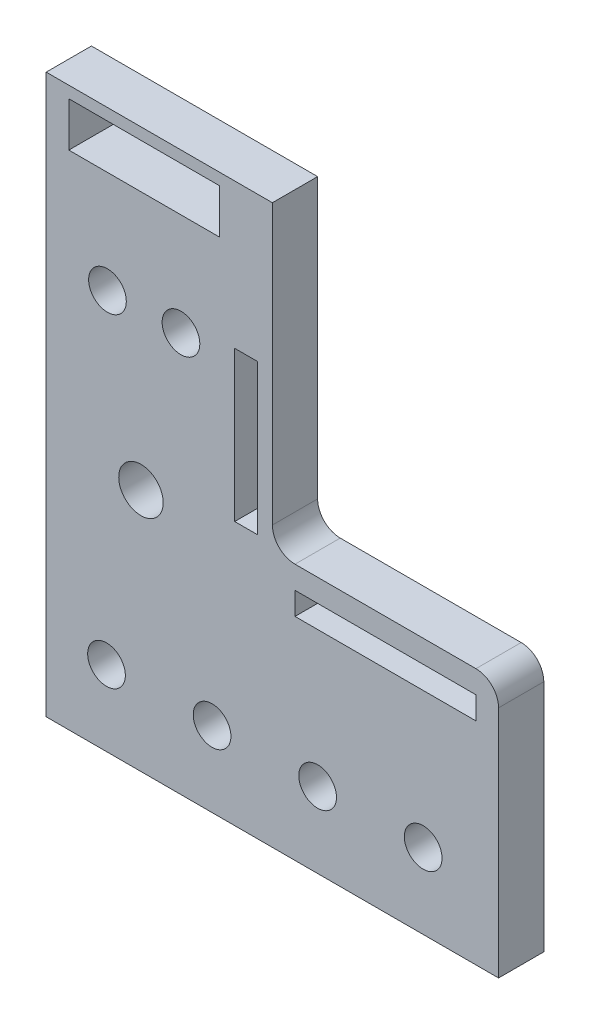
ISO-10303-21;
HEADER;
FILE_DESCRIPTION(('STEP AP214'),'2;1');
FILE_NAME('part.step','',(''),(''),'','','');
FILE_SCHEMA(('AUTOMOTIVE_DESIGN { 1 0 10303 214 1 1 1 1 }'));
ENDSEC;
DATA;
#1=APPLICATION_CONTEXT('core data for automotive mechanical design processes');
#2=APPLICATION_PROTOCOL_DEFINITION('international standard','automotive_design',2000,#1);
#3=PRODUCT_CONTEXT('',#1,'mechanical');
#4=PRODUCT('Part','Part','',(#3));
#5=PRODUCT_RELATED_PRODUCT_CATEGORY('part','',(#4));
#6=PRODUCT_DEFINITION_FORMATION('','',#4);
#7=PRODUCT_DEFINITION_CONTEXT('part definition',#1,'design');
#8=PRODUCT_DEFINITION('design','',#6,#7);
#9=PRODUCT_DEFINITION_SHAPE('','',#8);
#10=(LENGTH_UNIT() NAMED_UNIT(*) SI_UNIT(.MILLI.,.METRE.));
#11=(NAMED_UNIT(*) PLANE_ANGLE_UNIT() SI_UNIT($,.RADIAN.));
#12=(NAMED_UNIT(*) SI_UNIT($,.STERADIAN.) SOLID_ANGLE_UNIT());
#13=UNCERTAINTY_MEASURE_WITH_UNIT(LENGTH_MEASURE(1.E-05),#10,'distance_accuracy_value','');
#14=(GEOMETRIC_REPRESENTATION_CONTEXT(3) GLOBAL_UNCERTAINTY_ASSIGNED_CONTEXT((#13)) GLOBAL_UNIT_ASSIGNED_CONTEXT((#10,
#11,#12)) REPRESENTATION_CONTEXT('',''));
#15=CARTESIAN_POINT('',(0.,0.,0.));
#16=DIRECTION('',(0.,0.,1.));
#17=DIRECTION('',(1.,0.,0.));
#18=AXIS2_PLACEMENT_3D('',#15,#16,#17);
#19=CARTESIAN_POINT('',(-271.028662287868,23.730506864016,6.));
#20=DIRECTION('',(0.,0.,1.));
#21=DIRECTION('',(1.,0.,0.));
#22=AXIS2_PLACEMENT_3D('',#19,#20,#21);
#23=PLANE('',#22);
#24=CARTESIAN_POINT('',(-315.457743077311,25.0381031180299,6.));
#25=DIRECTION('',(0.,0.,1.));
#26=DIRECTION('',(1.,0.,0.));
#27=AXIS2_PLACEMENT_3D('',#24,#25,#26);
#28=CIRCLE('',#27,2.95000000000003);
#29=CARTESIAN_POINT('',(-312.507743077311,25.0381031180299,6.));
#30=VERTEX_POINT('',#29);
#31=EDGE_CURVE('E724',#30,#30,#28,.T.);
#32=ORIENTED_EDGE('',*,*,#31,.F.);
#33=EDGE_LOOP('',(#32));
#34=FACE_BOUND('',#33,.T.);
#35=DIRECTION('',(0.,-1.,0.));
#36=VECTOR('',#35,1.);
#37=CARTESIAN_POINT('',(-325.028662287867,65.1958099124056,6.));
#38=LINE('',#37,#36);
#39=CARTESIAN_POINT('',(-325.028662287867,65.1958099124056,6.));
#40=VERTEX_POINT('',#39);
#41=CARTESIAN_POINT('',(-325.028662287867,59.2958099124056,6.));
#42=VERTEX_POINT('',#41);
#43=EDGE_CURVE('E210',#40,#42,#38,.T.);
#44=ORIENTED_EDGE('',*,*,#43,.F.);
#45=DIRECTION('',(-1.,0.,0.));
#46=VECTOR('',#45,1.);
#47=CARTESIAN_POINT('',(-305.028662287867,65.1958099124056,6.));
#48=LINE('',#47,#46);
#49=CARTESIAN_POINT('',(-305.028662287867,65.1958099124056,6.));
#50=VERTEX_POINT('',#49);
#51=EDGE_CURVE('E208',#50,#40,#48,.T.);
#52=ORIENTED_EDGE('',*,*,#51,.F.);
#53=DIRECTION('',(0.,1.,0.));
#54=VECTOR('',#53,1.);
#55=CARTESIAN_POINT('',(-305.028662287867,59.2958099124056,6.));
#56=LINE('',#55,#54);
#57=CARTESIAN_POINT('',(-305.028662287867,59.2958099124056,6.));
#58=VERTEX_POINT('',#57);
#59=EDGE_CURVE('E216',#58,#50,#56,.T.);
#60=ORIENTED_EDGE('',*,*,#59,.F.);
#61=DIRECTION('',(1.,0.,0.));
#62=VECTOR('',#61,1.);
#63=CARTESIAN_POINT('',(-325.028662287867,59.2958099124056,6.));
#64=LINE('',#63,#62);
#65=EDGE_CURVE('E213',#42,#58,#64,.T.);
#66=ORIENTED_EDGE('',*,*,#65,.F.);
#67=EDGE_LOOP('',(#44,#52,#60,#66));
#68=FACE_BOUND('',#67,.T.);
#69=CARTESIAN_POINT('',(-319.903662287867,45.7269541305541,6.));
#70=DIRECTION('',(0.,0.,1.));
#71=DIRECTION('',(1.,0.,0.));
#72=AXIS2_PLACEMENT_3D('',#69,#70,#71);
#73=CIRCLE('',#72,2.50000000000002);
#74=CARTESIAN_POINT('',(-317.403662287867,45.7269541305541,6.));
#75=VERTEX_POINT('',#74);
#76=EDGE_CURVE('E245',#75,#75,#73,.T.);
#77=ORIENTED_EDGE('',*,*,#76,.F.);
#78=EDGE_LOOP('',(#77));
#79=FACE_BOUND('',#78,.T.);
#80=CARTESIAN_POINT('',(-292.028662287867,2.69858037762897,6.));
#81=DIRECTION('',(0.,0.,1.));
#82=DIRECTION('',(1.,0.,0.));
#83=AXIS2_PLACEMENT_3D('',#80,#81,#82);
#84=CIRCLE('',#83,2.50000000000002);
#85=CARTESIAN_POINT('',(-289.528662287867,2.69858037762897,6.));
#86=VERTEX_POINT('',#85);
#87=EDGE_CURVE('E257',#86,#86,#84,.T.);
#88=ORIENTED_EDGE('',*,*,#87,.F.);
#89=EDGE_LOOP('',(#88));
#90=FACE_BOUND('',#89,.T.);
#91=CARTESIAN_POINT('',(-320.028662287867,2.69858037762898,6.));
#92=DIRECTION('',(0.,0.,1.));
#93=DIRECTION('',(1.,0.,0.));
#94=AXIS2_PLACEMENT_3D('',#91,#92,#93);
#95=CIRCLE('',#94,2.50000000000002);
#96=CARTESIAN_POINT('',(-317.528662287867,2.69858037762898,6.));
#97=VERTEX_POINT('',#96);
#98=EDGE_CURVE('E269',#97,#97,#95,.T.);
#99=ORIENTED_EDGE('',*,*,#98,.F.);
#100=EDGE_LOOP('',(#99));
#101=FACE_BOUND('',#100,.T.);
#102=DIRECTION('',(-1.,0.,0.));
#103=VECTOR('',#102,1.);
#104=CARTESIAN_POINT('',(-298.028662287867,66.7514584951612,6.));
#105=LINE('',#104,#103);
#106=CARTESIAN_POINT('',(-298.028662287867,66.7514584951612,6.));
#107=VERTEX_POINT('',#106);
#108=CARTESIAN_POINT('',(-328.028662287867,66.7514584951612,6.));
#109=VERTEX_POINT('',#108);
#110=EDGE_CURVE('E306',#107,#109,#105,.T.);
#111=ORIENTED_EDGE('',*,*,#110,.T.);
#112=DIRECTION('',(0.,-1.,0.));
#113=VECTOR('',#112,1.);
#114=CARTESIAN_POINT('',(-328.028662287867,66.7514584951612,6.));
#115=LINE('',#114,#113);
#116=CARTESIAN_POINT('',(-328.028662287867,-7.30141962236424,6.));
#117=VERTEX_POINT('',#116);
#118=EDGE_CURVE('E309',#109,#117,#115,.T.);
#119=ORIENTED_EDGE('',*,*,#118,.T.);
#120=DIRECTION('',(1.,0.,0.));
#121=VECTOR('',#120,1.);
#122=CARTESIAN_POINT('',(-328.028662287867,-7.30141962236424,6.));
#123=LINE('',#122,#121);
#124=CARTESIAN_POINT('',(-268.028662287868,-7.30141962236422,6.));
#125=VERTEX_POINT('',#124);
#126=EDGE_CURVE('E312',#117,#125,#123,.T.);
#127=ORIENTED_EDGE('',*,*,#126,.T.);
#128=DIRECTION('',(0.,1.,0.));
#129=VECTOR('',#128,1.);
#130=CARTESIAN_POINT('',(-268.028662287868,-7.30141962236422,6.));
#131=LINE('',#130,#129);
#132=CARTESIAN_POINT('',(-268.028662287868,23.730506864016,6.));
#133=VERTEX_POINT('',#132);
#134=EDGE_CURVE('E314',#125,#133,#131,.T.);
#135=ORIENTED_EDGE('',*,*,#134,.T.);
#136=CARTESIAN_POINT('',(-271.028662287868,23.730506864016,6.));
#137=DIRECTION('',(0.,0.,1.));
#138=DIRECTION('',(1.,0.,0.));
#139=AXIS2_PLACEMENT_3D('',#136,#137,#138);
#140=CIRCLE('',#139,3.);
#141=CARTESIAN_POINT('',(-271.028662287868,26.730506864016,6.));
#142=VERTEX_POINT('',#141);
#143=EDGE_CURVE('E316',#133,#142,#140,.T.);
#144=ORIENTED_EDGE('',*,*,#143,.T.);
#145=DIRECTION('',(-1.,0.,0.));
#146=VECTOR('',#145,1.);
#147=CARTESIAN_POINT('',(-271.028662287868,26.730506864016,6.));
#148=LINE('',#147,#146);
#149=CARTESIAN_POINT('',(-295.028662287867,26.730506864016,6.));
#150=VERTEX_POINT('',#149);
#151=EDGE_CURVE('E318',#142,#150,#148,.T.);
#152=ORIENTED_EDGE('',*,*,#151,.T.);
#153=CARTESIAN_POINT('',(-295.028662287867,29.7305068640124,6.));
#154=DIRECTION('',(0.,0.,-1.));
#155=DIRECTION('',(-1.,0.,0.));
#156=AXIS2_PLACEMENT_3D('',#153,#154,#155);
#157=CIRCLE('',#156,2.99999999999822);
#158=CARTESIAN_POINT('',(-298.028662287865,29.7305068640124,6.));
#159=VERTEX_POINT('',#158);
#160=EDGE_CURVE('E320',#150,#159,#157,.T.);
#161=ORIENTED_EDGE('',*,*,#160,.T.);
#162=DIRECTION('',(0.,1.,0.));
#163=VECTOR('',#162,1.);
#164=CARTESIAN_POINT('',(-298.028662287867,29.7305068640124,6.));
#165=LINE('',#164,#163);
#166=EDGE_CURVE('E322',#159,#107,#165,.T.);
#167=ORIENTED_EDGE('',*,*,#166,.T.);
#168=EDGE_LOOP('',(#111,#119,#127,#135,#144,#152,#161,#167));
#169=FACE_BOUND('',#168,.T.);
#170=DIRECTION('',(-1.,0.,0.));
#171=VECTOR('',#170,1.);
#172=CARTESIAN_POINT('',(-271.028662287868,23.730506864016,6.));
#173=LINE('',#172,#171);
#174=CARTESIAN_POINT('',(-271.028662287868,23.730506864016,6.));
#175=VERTEX_POINT('',#174);
#176=CARTESIAN_POINT('',(-295.028662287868,23.730506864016,6.));
#177=VERTEX_POINT('',#176);
#178=EDGE_CURVE('E277',#175,#177,#173,.T.);
#179=ORIENTED_EDGE('',*,*,#178,.F.);
#180=DIRECTION('',(0.,1.,0.));
#181=VECTOR('',#180,1.);
#182=CARTESIAN_POINT('',(-271.028662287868,23.730506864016,6.));
#183=LINE('',#182,#181);
#184=CARTESIAN_POINT('',(-271.028662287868,20.730506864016,6.));
#185=VERTEX_POINT('',#184);
#186=EDGE_CURVE('E275',#185,#175,#183,.T.);
#187=ORIENTED_EDGE('',*,*,#186,.F.);
#188=DIRECTION('',(1.,0.,0.));
#189=VECTOR('',#188,1.);
#190=CARTESIAN_POINT('',(-271.028662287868,20.730506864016,6.));
#191=LINE('',#190,#189);
#192=CARTESIAN_POINT('',(-295.028662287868,20.730506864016,6.));
#193=VERTEX_POINT('',#192);
#194=EDGE_CURVE('E283',#193,#185,#191,.T.);
#195=ORIENTED_EDGE('',*,*,#194,.F.);
#196=DIRECTION('',(0.,-1.,0.));
#197=VECTOR('',#196,1.);
#198=CARTESIAN_POINT('',(-295.028662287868,23.730506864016,6.));
#199=LINE('',#198,#197);
#200=EDGE_CURVE('E280',#177,#193,#199,.T.);
#201=ORIENTED_EDGE('',*,*,#200,.F.);
#202=EDGE_LOOP('',(#179,#187,#195,#201));
#203=FACE_BOUND('',#202,.T.);
#204=CARTESIAN_POINT('',(-306.028662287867,2.69858037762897,6.));
#205=DIRECTION('',(0.,0.,1.));
#206=DIRECTION('',(1.,0.,0.));
#207=AXIS2_PLACEMENT_3D('',#204,#205,#206);
#208=CIRCLE('',#207,2.50000000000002);
#209=CARTESIAN_POINT('',(-303.528662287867,2.69858037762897,6.));
#210=VERTEX_POINT('',#209);
#211=EDGE_CURVE('E263',#210,#210,#208,.T.);
#212=ORIENTED_EDGE('',*,*,#211,.F.);
#213=EDGE_LOOP('',(#212));
#214=FACE_BOUND('',#213,.T.);
#215=CARTESIAN_POINT('',(-278.028662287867,2.69858037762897,6.));
#216=DIRECTION('',(0.,0.,1.));
#217=DIRECTION('',(1.,0.,0.));
#218=AXIS2_PLACEMENT_3D('',#215,#216,#217);
#219=CIRCLE('',#218,2.50000000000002);
#220=CARTESIAN_POINT('',(-275.528662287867,2.69858037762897,6.));
#221=VERTEX_POINT('',#220);
#222=EDGE_CURVE('E251',#221,#221,#219,.T.);
#223=ORIENTED_EDGE('',*,*,#222,.F.);
#224=EDGE_LOOP('',(#223));
#225=FACE_BOUND('',#224,.T.);
#226=CARTESIAN_POINT('',(-310.153662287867,45.7269541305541,6.));
#227=DIRECTION('',(0.,0.,1.));
#228=DIRECTION('',(1.,0.,0.));
#229=AXIS2_PLACEMENT_3D('',#226,#227,#228);
#230=CIRCLE('',#229,2.50000000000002);
#231=CARTESIAN_POINT('',(-307.653662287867,45.7269541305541,6.));
#232=VERTEX_POINT('',#231);
#233=EDGE_CURVE('E239',#232,#232,#230,.T.);
#234=ORIENTED_EDGE('',*,*,#233,.F.);
#235=EDGE_LOOP('',(#234));
#236=FACE_BOUND('',#235,.T.);
#237=DIRECTION('',(1.,0.,0.));
#238=VECTOR('',#237,1.);
#239=CARTESIAN_POINT('',(-300.028662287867,27.6308045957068,6.));
#240=LINE('',#239,#238);
#241=CARTESIAN_POINT('',(-303.028662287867,27.6308045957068,6.));
#242=VERTEX_POINT('',#241);
#243=CARTESIAN_POINT('',(-300.028662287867,27.6308045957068,6.));
#244=VERTEX_POINT('',#243);
#245=EDGE_CURVE('E178',#242,#244,#240,.T.);
#246=ORIENTED_EDGE('',*,*,#245,.F.);
#247=DIRECTION('',(0.,-1.,0.));
#248=VECTOR('',#247,1.);
#249=CARTESIAN_POINT('',(-303.028662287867,27.6308045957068,6.));
#250=LINE('',#249,#248);
#251=CARTESIAN_POINT('',(-303.028662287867,47.5294663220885,6.));
#252=VERTEX_POINT('',#251);
#253=EDGE_CURVE('E170',#252,#242,#250,.T.);
#254=ORIENTED_EDGE('',*,*,#253,.F.);
#255=DIRECTION('',(-1.,0.,0.));
#256=VECTOR('',#255,1.);
#257=CARTESIAN_POINT('',(-303.028662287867,47.5294663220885,6.));
#258=LINE('',#257,#256);
#259=CARTESIAN_POINT('',(-300.028662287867,47.5294663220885,6.));
#260=VERTEX_POINT('',#259);
#261=EDGE_CURVE('E192',#260,#252,#258,.T.);
#262=ORIENTED_EDGE('',*,*,#261,.F.);
#263=DIRECTION('',(0.,1.,0.));
#264=VECTOR('',#263,1.);
#265=CARTESIAN_POINT('',(-300.028662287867,47.5294663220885,6.));
#266=LINE('',#265,#264);
#267=EDGE_CURVE('E190',#244,#260,#266,.T.);
#268=ORIENTED_EDGE('',*,*,#267,.F.);
#269=EDGE_LOOP('',(#246,#254,#262,#268));
#270=FACE_BOUND('',#269,.T.);
#271=ADVANCED_FACE('F33',(#34,#68,#79,#90,#101,#169,#203,#214,#225,#236,#270),#23,.T.);
#272=CARTESIAN_POINT('',(-271.028662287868,23.730506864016,0.));
#273=DIRECTION('',(0.,0.,1.));
#274=DIRECTION('',(1.,0.,0.));
#275=AXIS2_PLACEMENT_3D('',#272,#273,#274);
#276=PLANE('',#275);
#277=CARTESIAN_POINT('',(-315.457743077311,25.0381031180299,0.));
#278=DIRECTION('',(0.,0.,-1.));
#279=DIRECTION('',(-1.,0.,0.));
#280=AXIS2_PLACEMENT_3D('',#277,#278,#279);
#281=CIRCLE('',#280,2.95000000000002);
#282=CARTESIAN_POINT('',(-318.407743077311,25.0381031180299,0.));
#283=VERTEX_POINT('',#282);
#284=EDGE_CURVE('E198',#283,#283,#281,.T.);
#285=ORIENTED_EDGE('',*,*,#284,.F.);
#286=EDGE_LOOP('',(#285));
#287=FACE_BOUND('',#286,.T.);
#288=DIRECTION('',(-1.,0.,0.));
#289=VECTOR('',#288,1.);
#290=CARTESIAN_POINT('',(-305.028662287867,65.1958099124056,0.));
#291=LINE('',#290,#289);
#292=CARTESIAN_POINT('',(-305.028662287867,65.1958099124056,0.));
#293=VERTEX_POINT('',#292);
#294=CARTESIAN_POINT('',(-325.028662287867,65.1958099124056,0.));
#295=VERTEX_POINT('',#294);
#296=EDGE_CURVE('E186',#293,#295,#291,.T.);
#297=ORIENTED_EDGE('',*,*,#296,.T.);
#298=DIRECTION('',(0.,-1.,0.));
#299=VECTOR('',#298,1.);
#300=CARTESIAN_POINT('',(-325.028662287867,65.1958099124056,0.));
#301=LINE('',#300,#299);
#302=CARTESIAN_POINT('',(-325.028662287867,59.2958099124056,0.));
#303=VERTEX_POINT('',#302);
#304=EDGE_CURVE('E221',#295,#303,#301,.T.);
#305=ORIENTED_EDGE('',*,*,#304,.T.);
#306=DIRECTION('',(1.,0.,0.));
#307=VECTOR('',#306,1.);
#308=CARTESIAN_POINT('',(-325.028662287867,59.2958099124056,0.));
#309=LINE('',#308,#307);
#310=CARTESIAN_POINT('',(-305.028662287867,59.2958099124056,0.));
#311=VERTEX_POINT('',#310);
#312=EDGE_CURVE('E224',#303,#311,#309,.T.);
#313=ORIENTED_EDGE('',*,*,#312,.T.);
#314=DIRECTION('',(0.,1.,0.));
#315=VECTOR('',#314,1.);
#316=CARTESIAN_POINT('',(-305.028662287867,59.2958099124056,0.));
#317=LINE('',#316,#315);
#318=EDGE_CURVE('E211',#311,#293,#317,.T.);
#319=ORIENTED_EDGE('',*,*,#318,.T.);
#320=EDGE_LOOP('',(#297,#305,#313,#319));
#321=FACE_BOUND('',#320,.T.);
#322=CARTESIAN_POINT('',(-319.903662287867,45.7269541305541,0.));
#323=DIRECTION('',(0.,0.,1.));
#324=DIRECTION('',(1.,0.,0.));
#325=AXIS2_PLACEMENT_3D('',#322,#323,#324);
#326=CIRCLE('',#325,2.50000000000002);
#327=CARTESIAN_POINT('',(-317.403662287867,45.7269541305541,0.));
#328=VERTEX_POINT('',#327);
#329=EDGE_CURVE('E242',#328,#328,#326,.T.);
#330=ORIENTED_EDGE('',*,*,#329,.T.);
#331=EDGE_LOOP('',(#330));
#332=FACE_BOUND('',#331,.T.);
#333=CARTESIAN_POINT('',(-292.028662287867,2.69858037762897,0.));
#334=DIRECTION('',(0.,0.,1.));
#335=DIRECTION('',(1.,0.,0.));
#336=AXIS2_PLACEMENT_3D('',#333,#334,#335);
#337=CIRCLE('',#336,2.50000000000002);
#338=CARTESIAN_POINT('',(-289.528662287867,2.69858037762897,0.));
#339=VERTEX_POINT('',#338);
#340=EDGE_CURVE('E254',#339,#339,#337,.T.);
#341=ORIENTED_EDGE('',*,*,#340,.T.);
#342=EDGE_LOOP('',(#341));
#343=FACE_BOUND('',#342,.T.);
#344=CARTESIAN_POINT('',(-320.028662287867,2.69858037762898,0.));
#345=DIRECTION('',(0.,0.,1.));
#346=DIRECTION('',(1.,0.,0.));
#347=AXIS2_PLACEMENT_3D('',#344,#345,#346);
#348=CIRCLE('',#347,2.50000000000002);
#349=CARTESIAN_POINT('',(-317.528662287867,2.69858037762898,0.));
#350=VERTEX_POINT('',#349);
#351=EDGE_CURVE('E266',#350,#350,#348,.T.);
#352=ORIENTED_EDGE('',*,*,#351,.T.);
#353=EDGE_LOOP('',(#352));
#354=FACE_BOUND('',#353,.T.);
#355=DIRECTION('',(-1.,0.,0.));
#356=VECTOR('',#355,1.);
#357=CARTESIAN_POINT('',(-298.028662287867,66.7514584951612,0.));
#358=LINE('',#357,#356);
#359=CARTESIAN_POINT('',(-298.028662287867,66.7514584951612,0.));
#360=VERTEX_POINT('',#359);
#361=CARTESIAN_POINT('',(-328.028662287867,66.7514584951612,0.));
#362=VERTEX_POINT('',#361);
#363=EDGE_CURVE('E305',#360,#362,#358,.T.);
#364=ORIENTED_EDGE('',*,*,#363,.F.);
#365=DIRECTION('',(0.,1.,0.));
#366=VECTOR('',#365,1.);
#367=CARTESIAN_POINT('',(-298.028662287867,29.7305068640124,0.));
#368=LINE('',#367,#366);
#369=CARTESIAN_POINT('',(-298.028662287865,29.7305068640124,0.));
#370=VERTEX_POINT('',#369);
#371=EDGE_CURVE('E310',#370,#360,#368,.T.);
#372=ORIENTED_EDGE('',*,*,#371,.F.);
#373=CARTESIAN_POINT('',(-295.028662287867,29.7305068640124,0.));
#374=DIRECTION('',(0.,0.,-1.));
#375=DIRECTION('',(-1.,0.,0.));
#376=AXIS2_PLACEMENT_3D('',#373,#374,#375);
#377=CIRCLE('',#376,2.99999999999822);
#378=CARTESIAN_POINT('',(-295.028662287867,26.730506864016,0.));
#379=VERTEX_POINT('',#378);
#380=EDGE_CURVE('E337',#379,#370,#377,.T.);
#381=ORIENTED_EDGE('',*,*,#380,.F.);
#382=DIRECTION('',(-1.,0.,0.));
#383=VECTOR('',#382,1.);
#384=CARTESIAN_POINT('',(-271.028662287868,26.730506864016,0.));
#385=LINE('',#384,#383);
#386=CARTESIAN_POINT('',(-271.028662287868,26.730506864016,0.));
#387=VERTEX_POINT('',#386);
#388=EDGE_CURVE('E335',#387,#379,#385,.T.);
#389=ORIENTED_EDGE('',*,*,#388,.F.);
#390=CARTESIAN_POINT('',(-271.028662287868,23.730506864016,0.));
#391=DIRECTION('',(0.,0.,1.));
#392=DIRECTION('',(1.,0.,0.));
#393=AXIS2_PLACEMENT_3D('',#390,#391,#392);
#394=CIRCLE('',#393,3.);
#395=CARTESIAN_POINT('',(-268.028662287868,23.730506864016,0.));
#396=VERTEX_POINT('',#395);
#397=EDGE_CURVE('E333',#396,#387,#394,.T.);
#398=ORIENTED_EDGE('',*,*,#397,.F.);
#399=DIRECTION('',(0.,1.,0.));
#400=VECTOR('',#399,1.);
#401=CARTESIAN_POINT('',(-268.028662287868,-7.30141962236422,0.));
#402=LINE('',#401,#400);
#403=CARTESIAN_POINT('',(-268.028662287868,-7.30141962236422,0.));
#404=VERTEX_POINT('',#403);
#405=EDGE_CURVE('E331',#404,#396,#402,.T.);
#406=ORIENTED_EDGE('',*,*,#405,.F.);
#407=DIRECTION('',(1.,0.,0.));
#408=VECTOR('',#407,1.);
#409=CARTESIAN_POINT('',(-328.028662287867,-7.30141962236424,0.));
#410=LINE('',#409,#408);
#411=CARTESIAN_POINT('',(-328.028662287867,-7.30141962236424,0.));
#412=VERTEX_POINT('',#411);
#413=EDGE_CURVE('E329',#412,#404,#410,.T.);
#414=ORIENTED_EDGE('',*,*,#413,.F.);
#415=DIRECTION('',(0.,-1.,0.));
#416=VECTOR('',#415,1.);
#417=CARTESIAN_POINT('',(-328.028662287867,66.7514584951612,0.));
#418=LINE('',#417,#416);
#419=EDGE_CURVE('E327',#362,#412,#418,.T.);
#420=ORIENTED_EDGE('',*,*,#419,.F.);
#421=EDGE_LOOP('',(#364,#372,#381,#389,#398,#406,#414,#420));
#422=FACE_BOUND('',#421,.T.);
#423=DIRECTION('',(0.,1.,0.));
#424=VECTOR('',#423,1.);
#425=CARTESIAN_POINT('',(-271.028662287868,23.730506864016,0.));
#426=LINE('',#425,#424);
#427=CARTESIAN_POINT('',(-271.028662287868,20.730506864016,0.));
#428=VERTEX_POINT('',#427);
#429=CARTESIAN_POINT('',(-271.028662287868,23.730506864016,0.));
#430=VERTEX_POINT('',#429);
#431=EDGE_CURVE('E272',#428,#430,#426,.T.);
#432=ORIENTED_EDGE('',*,*,#431,.T.);
#433=DIRECTION('',(-1.,0.,0.));
#434=VECTOR('',#433,1.);
#435=CARTESIAN_POINT('',(-271.028662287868,23.730506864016,0.));
#436=LINE('',#435,#434);
#437=CARTESIAN_POINT('',(-295.028662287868,23.730506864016,0.));
#438=VERTEX_POINT('',#437);
#439=EDGE_CURVE('E288',#430,#438,#436,.T.);
#440=ORIENTED_EDGE('',*,*,#439,.T.);
#441=DIRECTION('',(0.,-1.,0.));
#442=VECTOR('',#441,1.);
#443=CARTESIAN_POINT('',(-295.028662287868,23.730506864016,0.));
#444=LINE('',#443,#442);
#445=CARTESIAN_POINT('',(-295.028662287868,20.730506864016,0.));
#446=VERTEX_POINT('',#445);
#447=EDGE_CURVE('E291',#438,#446,#444,.T.);
#448=ORIENTED_EDGE('',*,*,#447,.T.);
#449=DIRECTION('',(1.,0.,0.));
#450=VECTOR('',#449,1.);
#451=CARTESIAN_POINT('',(-271.028662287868,20.730506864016,0.));
#452=LINE('',#451,#450);
#453=EDGE_CURVE('E278',#446,#428,#452,.T.);
#454=ORIENTED_EDGE('',*,*,#453,.T.);
#455=EDGE_LOOP('',(#432,#440,#448,#454));
#456=FACE_BOUND('',#455,.T.);
#457=CARTESIAN_POINT('',(-306.028662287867,2.69858037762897,0.));
#458=DIRECTION('',(0.,0.,1.));
#459=DIRECTION('',(1.,0.,0.));
#460=AXIS2_PLACEMENT_3D('',#457,#458,#459);
#461=CIRCLE('',#460,2.50000000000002);
#462=CARTESIAN_POINT('',(-303.528662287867,2.69858037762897,0.));
#463=VERTEX_POINT('',#462);
#464=EDGE_CURVE('E260',#463,#463,#461,.T.);
#465=ORIENTED_EDGE('',*,*,#464,.T.);
#466=EDGE_LOOP('',(#465));
#467=FACE_BOUND('',#466,.T.);
#468=CARTESIAN_POINT('',(-278.028662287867,2.69858037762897,0.));
#469=DIRECTION('',(0.,0.,1.));
#470=DIRECTION('',(1.,0.,0.));
#471=AXIS2_PLACEMENT_3D('',#468,#469,#470);
#472=CIRCLE('',#471,2.50000000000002);
#473=CARTESIAN_POINT('',(-275.528662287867,2.69858037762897,0.));
#474=VERTEX_POINT('',#473);
#475=EDGE_CURVE('E248',#474,#474,#472,.T.);
#476=ORIENTED_EDGE('',*,*,#475,.T.);
#477=EDGE_LOOP('',(#476));
#478=FACE_BOUND('',#477,.T.);
#479=CARTESIAN_POINT('',(-310.153662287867,45.7269541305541,0.));
#480=DIRECTION('',(0.,0.,1.));
#481=DIRECTION('',(1.,0.,0.));
#482=AXIS2_PLACEMENT_3D('',#479,#480,#481);
#483=CIRCLE('',#482,2.50000000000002);
#484=CARTESIAN_POINT('',(-307.653662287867,45.7269541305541,0.));
#485=VERTEX_POINT('',#484);
#486=EDGE_CURVE('E238',#485,#485,#483,.T.);
#487=ORIENTED_EDGE('',*,*,#486,.T.);
#488=EDGE_LOOP('',(#487));
#489=FACE_BOUND('',#488,.T.);
#490=DIRECTION('',(0.,-1.,0.));
#491=VECTOR('',#490,1.);
#492=CARTESIAN_POINT('',(-303.028662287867,27.6308045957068,0.));
#493=LINE('',#492,#491);
#494=CARTESIAN_POINT('',(-303.028662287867,47.5294663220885,0.));
#495=VERTEX_POINT('',#494);
#496=CARTESIAN_POINT('',(-303.028662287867,27.6308045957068,0.));
#497=VERTEX_POINT('',#496);
#498=EDGE_CURVE('E56',#495,#497,#493,.T.);
#499=ORIENTED_EDGE('',*,*,#498,.T.);
#500=DIRECTION('',(1.,0.,0.));
#501=VECTOR('',#500,1.);
#502=CARTESIAN_POINT('',(-300.028662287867,27.6308045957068,0.));
#503=LINE('',#502,#501);
#504=CARTESIAN_POINT('',(-300.028662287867,27.6308045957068,0.));
#505=VERTEX_POINT('',#504);
#506=EDGE_CURVE('E185',#497,#505,#503,.T.);
#507=ORIENTED_EDGE('',*,*,#506,.T.);
#508=DIRECTION('',(0.,1.,0.));
#509=VECTOR('',#508,1.);
#510=CARTESIAN_POINT('',(-300.028662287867,47.5294663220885,0.));
#511=LINE('',#510,#509);
#512=CARTESIAN_POINT('',(-300.028662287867,47.5294663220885,0.));
#513=VERTEX_POINT('',#512);
#514=EDGE_CURVE('E200',#505,#513,#511,.T.);
#515=ORIENTED_EDGE('',*,*,#514,.T.);
#516=DIRECTION('',(-1.,0.,0.));
#517=VECTOR('',#516,1.);
#518=CARTESIAN_POINT('',(-303.028662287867,47.5294663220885,0.));
#519=LINE('',#518,#517);
#520=EDGE_CURVE('E179',#513,#495,#519,.T.);
#521=ORIENTED_EDGE('',*,*,#520,.T.);
#522=EDGE_LOOP('',(#499,#507,#515,#521));
#523=FACE_BOUND('',#522,.T.);
#524=ADVANCED_FACE('F367',(#287,#321,#332,#343,#354,#422,#456,#467,#478,#489,#523),#276,.F.);
#525=CARTESIAN_POINT('',(-298.028662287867,66.7514584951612,6.));
#526=DIRECTION('',(0.,-1.,0.));
#527=DIRECTION('',(1.,0.,0.));
#528=AXIS2_PLACEMENT_3D('',#525,#526,#527);
#529=PLANE('',#528);
#530=ORIENTED_EDGE('',*,*,#363,.T.);
#531=DIRECTION('',(0.,0.,-1.));
#532=VECTOR('',#531,1.);
#533=CARTESIAN_POINT('',(-328.028662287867,66.7514584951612,6.));
#534=LINE('',#533,#532);
#535=EDGE_CURVE('E11',#109,#362,#534,.T.);
#536=ORIENTED_EDGE('',*,*,#535,.F.);
#537=ORIENTED_EDGE('',*,*,#110,.F.);
#538=DIRECTION('',(0.,0.,-1.));
#539=VECTOR('',#538,1.);
#540=CARTESIAN_POINT('',(-298.028662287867,66.7514584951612,6.));
#541=LINE('',#540,#539);
#542=EDGE_CURVE('E324',#107,#360,#541,.T.);
#543=ORIENTED_EDGE('',*,*,#542,.T.);
#544=EDGE_LOOP('',(#530,#536,#537,#543));
#545=FACE_BOUND('',#544,.T.);
#546=ADVANCED_FACE('F35',(#545),#529,.F.);
#547=CARTESIAN_POINT('',(-328.028662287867,66.7514584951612,6.));
#548=DIRECTION('',(1.,0.,0.));
#549=DIRECTION('',(0.,0.,-1.));
#550=AXIS2_PLACEMENT_3D('',#547,#548,#549);
#551=PLANE('',#550);
#552=ORIENTED_EDGE('',*,*,#419,.T.);
#553=DIRECTION('',(0.,0.,-1.));
#554=VECTOR('',#553,1.);
#555=CARTESIAN_POINT('',(-328.028662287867,-7.30141962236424,6.));
#556=LINE('',#555,#554);
#557=EDGE_CURVE('E41',#117,#412,#556,.T.);
#558=ORIENTED_EDGE('',*,*,#557,.F.);
#559=ORIENTED_EDGE('',*,*,#118,.F.);
#560=ORIENTED_EDGE('',*,*,#535,.T.);
#561=EDGE_LOOP('',(#552,#558,#559,#560));
#562=FACE_BOUND('',#561,.T.);
#563=ADVANCED_FACE('F385',(#562),#551,.F.);
#564=CARTESIAN_POINT('',(-328.028662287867,-7.30141962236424,6.));
#565=DIRECTION('',(0.,1.,0.));
#566=DIRECTION('',(-1.,0.,0.));
#567=AXIS2_PLACEMENT_3D('',#564,#565,#566);
#568=PLANE('',#567);
#569=ORIENTED_EDGE('',*,*,#413,.T.);
#570=DIRECTION('',(0.,0.,-1.));
#571=VECTOR('',#570,1.);
#572=CARTESIAN_POINT('',(-268.028662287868,-7.30141962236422,6.));
#573=LINE('',#572,#571);
#574=EDGE_CURVE('E354',#125,#404,#573,.T.);
#575=ORIENTED_EDGE('',*,*,#574,.F.);
#576=ORIENTED_EDGE('',*,*,#126,.F.);
#577=ORIENTED_EDGE('',*,*,#557,.T.);
#578=EDGE_LOOP('',(#569,#575,#576,#577));
#579=FACE_BOUND('',#578,.T.);
#580=ADVANCED_FACE('F361',(#579),#568,.F.);
#581=CARTESIAN_POINT('',(-268.028662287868,-7.30141962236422,6.));
#582=DIRECTION('',(-1.,0.,0.));
#583=DIRECTION('',(0.,0.,1.));
#584=AXIS2_PLACEMENT_3D('',#581,#582,#583);
#585=PLANE('',#584);
#586=ORIENTED_EDGE('',*,*,#405,.T.);
#587=DIRECTION('',(0.,0.,-1.));
#588=VECTOR('',#587,1.);
#589=CARTESIAN_POINT('',(-268.028662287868,23.730506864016,6.));
#590=LINE('',#589,#588);
#591=EDGE_CURVE('E351',#133,#396,#590,.T.);
#592=ORIENTED_EDGE('',*,*,#591,.F.);
#593=ORIENTED_EDGE('',*,*,#134,.F.);
#594=ORIENTED_EDGE('',*,*,#574,.T.);
#595=EDGE_LOOP('',(#586,#592,#593,#594));
#596=FACE_BOUND('',#595,.T.);
#597=ADVANCED_FACE('F373',(#596),#585,.F.);
#598=CARTESIAN_POINT('',(-271.028662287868,23.730506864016,6.));
#599=DIRECTION('',(0.,0.,-1.));
#600=DIRECTION('',(-1.,0.,0.));
#601=AXIS2_PLACEMENT_3D('',#598,#599,#600);
#602=CYLINDRICAL_SURFACE('',#601,3.);
#603=ORIENTED_EDGE('',*,*,#397,.T.);
#604=DIRECTION('',(0.,0.,-1.));
#605=VECTOR('',#604,1.);
#606=CARTESIAN_POINT('',(-271.028662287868,26.730506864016,6.));
#607=LINE('',#606,#605);
#608=EDGE_CURVE('E348',#142,#387,#607,.T.);
#609=ORIENTED_EDGE('',*,*,#608,.F.);
#610=ORIENTED_EDGE('',*,*,#143,.F.);
#611=ORIENTED_EDGE('',*,*,#591,.T.);
#612=EDGE_LOOP('',(#603,#609,#610,#611));
#613=FACE_BOUND('',#612,.T.);
#614=ADVANCED_FACE('F377',(#613),#602,.T.);
#615=CARTESIAN_POINT('',(-271.028662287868,26.730506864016,6.));
#616=DIRECTION('',(0.,-1.,0.));
#617=DIRECTION('',(1.,0.,0.));
#618=AXIS2_PLACEMENT_3D('',#615,#616,#617);
#619=PLANE('',#618);
#620=ORIENTED_EDGE('',*,*,#388,.T.);
#621=DIRECTION('',(0.,0.,-1.));
#622=VECTOR('',#621,1.);
#623=CARTESIAN_POINT('',(-295.028662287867,26.730506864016,6.));
#624=LINE('',#623,#622);
#625=EDGE_CURVE('E345',#150,#379,#624,.T.);
#626=ORIENTED_EDGE('',*,*,#625,.F.);
#627=ORIENTED_EDGE('',*,*,#151,.F.);
#628=ORIENTED_EDGE('',*,*,#608,.T.);
#629=EDGE_LOOP('',(#620,#626,#627,#628));
#630=FACE_BOUND('',#629,.T.);
#631=ADVANCED_FACE('F398',(#630),#619,.F.);
#632=CARTESIAN_POINT('',(-295.028662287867,29.7305068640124,6.));
#633=DIRECTION('',(0.,0.,-1.));
#634=DIRECTION('',(-1.,0.,0.));
#635=AXIS2_PLACEMENT_3D('',#632,#633,#634);
#636=CYLINDRICAL_SURFACE('',#635,2.99999999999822);
#637=ORIENTED_EDGE('',*,*,#380,.T.);
#638=DIRECTION('',(0.,0.,-1.));
#639=VECTOR('',#638,1.);
#640=CARTESIAN_POINT('',(-298.028662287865,29.7305068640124,6.));
#641=LINE('',#640,#639);
#642=EDGE_CURVE('E342',#159,#370,#641,.T.);
#643=ORIENTED_EDGE('',*,*,#642,.F.);
#644=ORIENTED_EDGE('',*,*,#160,.F.);
#645=ORIENTED_EDGE('',*,*,#625,.T.);
#646=EDGE_LOOP('',(#637,#643,#644,#645));
#647=FACE_BOUND('',#646,.T.);
#648=ADVANCED_FACE('F396',(#647),#636,.F.);
#649=CARTESIAN_POINT('',(-298.028662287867,29.7305068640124,6.));
#650=DIRECTION('',(-1.,0.,0.));
#651=DIRECTION('',(0.,0.,1.));
#652=AXIS2_PLACEMENT_3D('',#649,#650,#651);
#653=PLANE('',#652);
#654=ORIENTED_EDGE('',*,*,#371,.T.);
#655=ORIENTED_EDGE('',*,*,#542,.F.);
#656=ORIENTED_EDGE('',*,*,#166,.F.);
#657=ORIENTED_EDGE('',*,*,#642,.T.);
#658=EDGE_LOOP('',(#654,#655,#656,#657));
#659=FACE_BOUND('',#658,.T.);
#660=ADVANCED_FACE('F391',(#659),#653,.F.);
#661=CARTESIAN_POINT('',(-271.028662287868,23.730506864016,6.));
#662=DIRECTION('',(-1.,0.,0.));
#663=DIRECTION('',(0.,0.,1.));
#664=AXIS2_PLACEMENT_3D('',#661,#662,#663);
#665=PLANE('',#664);
#666=ORIENTED_EDGE('',*,*,#431,.F.);
#667=DIRECTION('',(0.,0.,-1.));
#668=VECTOR('',#667,1.);
#669=CARTESIAN_POINT('',(-271.028662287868,20.730506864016,6.));
#670=LINE('',#669,#668);
#671=EDGE_CURVE('E285',#185,#428,#670,.T.);
#672=ORIENTED_EDGE('',*,*,#671,.F.);
#673=ORIENTED_EDGE('',*,*,#186,.T.);
#674=DIRECTION('',(0.,0.,-1.));
#675=VECTOR('',#674,1.);
#676=CARTESIAN_POINT('',(-271.028662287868,23.730506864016,6.));
#677=LINE('',#676,#675);
#678=EDGE_CURVE('E302',#175,#430,#677,.T.);
#679=ORIENTED_EDGE('',*,*,#678,.T.);
#680=EDGE_LOOP('',(#666,#672,#673,#679));
#681=FACE_BOUND('',#680,.T.);
#682=ADVANCED_FACE('F419',(#681),#665,.T.);
#683=CARTESIAN_POINT('',(-271.028662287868,23.730506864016,6.));
#684=DIRECTION('',(0.,-1.,0.));
#685=DIRECTION('',(0.,0.,-1.));
#686=AXIS2_PLACEMENT_3D('',#683,#684,#685);
#687=PLANE('',#686);
#688=ORIENTED_EDGE('',*,*,#439,.F.);
#689=ORIENTED_EDGE('',*,*,#678,.F.);
#690=ORIENTED_EDGE('',*,*,#178,.T.);
#691=DIRECTION('',(0.,0.,-1.));
#692=VECTOR('',#691,1.);
#693=CARTESIAN_POINT('',(-295.028662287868,23.730506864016,6.));
#694=LINE('',#693,#692);
#695=EDGE_CURVE('E300',#177,#438,#694,.T.);
#696=ORIENTED_EDGE('',*,*,#695,.T.);
#697=EDGE_LOOP('',(#688,#689,#690,#696));
#698=FACE_BOUND('',#697,.T.);
#699=ADVANCED_FACE('F426',(#698),#687,.T.);
#700=CARTESIAN_POINT('',(-295.028662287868,23.730506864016,6.));
#701=DIRECTION('',(1.,0.,0.));
#702=DIRECTION('',(0.,0.,-1.));
#703=AXIS2_PLACEMENT_3D('',#700,#701,#702);
#704=PLANE('',#703);
#705=ORIENTED_EDGE('',*,*,#447,.F.);
#706=ORIENTED_EDGE('',*,*,#695,.F.);
#707=ORIENTED_EDGE('',*,*,#200,.T.);
#708=DIRECTION('',(0.,0.,-1.));
#709=VECTOR('',#708,1.);
#710=CARTESIAN_POINT('',(-295.028662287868,20.730506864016,6.));
#711=LINE('',#710,#709);
#712=EDGE_CURVE('E298',#193,#446,#711,.T.);
#713=ORIENTED_EDGE('',*,*,#712,.T.);
#714=EDGE_LOOP('',(#705,#706,#707,#713));
#715=FACE_BOUND('',#714,.T.);
#716=ADVANCED_FACE('F431',(#715),#704,.T.);
#717=CARTESIAN_POINT('',(-271.028662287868,20.730506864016,6.));
#718=DIRECTION('',(0.,1.,0.));
#719=DIRECTION('',(0.,0.,1.));
#720=AXIS2_PLACEMENT_3D('',#717,#718,#719);
#721=PLANE('',#720);
#722=ORIENTED_EDGE('',*,*,#453,.F.);
#723=ORIENTED_EDGE('',*,*,#712,.F.);
#724=ORIENTED_EDGE('',*,*,#194,.T.);
#725=ORIENTED_EDGE('',*,*,#671,.T.);
#726=EDGE_LOOP('',(#722,#723,#724,#725));
#727=FACE_BOUND('',#726,.T.);
#728=ADVANCED_FACE('F438',(#727),#721,.T.);
#729=CARTESIAN_POINT('',(-320.028662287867,2.69858037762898,6.));
#730=DIRECTION('',(0.,0.,-1.));
#731=DIRECTION('',(-1.,0.,0.));
#732=AXIS2_PLACEMENT_3D('',#729,#730,#731);
#733=CYLINDRICAL_SURFACE('',#732,2.50000000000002);
#734=ORIENTED_EDGE('',*,*,#98,.T.);
#735=EDGE_LOOP('',(#734));
#736=FACE_BOUND('',#735,.T.);
#737=ORIENTED_EDGE('',*,*,#351,.F.);
#738=EDGE_LOOP('',(#737));
#739=FACE_BOUND('',#738,.T.);
#740=ADVANCED_FACE('F510',(#736,#739),#733,.F.);
#741=CARTESIAN_POINT('',(-306.028662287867,2.69858037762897,6.));
#742=DIRECTION('',(0.,0.,-1.));
#743=DIRECTION('',(-1.,0.,0.));
#744=AXIS2_PLACEMENT_3D('',#741,#742,#743);
#745=CYLINDRICAL_SURFACE('',#744,2.50000000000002);
#746=ORIENTED_EDGE('',*,*,#211,.T.);
#747=EDGE_LOOP('',(#746));
#748=FACE_BOUND('',#747,.T.);
#749=ORIENTED_EDGE('',*,*,#464,.F.);
#750=EDGE_LOOP('',(#749));
#751=FACE_BOUND('',#750,.T.);
#752=ADVANCED_FACE('F506',(#748,#751),#745,.F.);
#753=CARTESIAN_POINT('',(-292.028662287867,2.69858037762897,6.));
#754=DIRECTION('',(0.,0.,-1.));
#755=DIRECTION('',(-1.,0.,0.));
#756=AXIS2_PLACEMENT_3D('',#753,#754,#755);
#757=CYLINDRICAL_SURFACE('',#756,2.50000000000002);
#758=ORIENTED_EDGE('',*,*,#87,.T.);
#759=EDGE_LOOP('',(#758));
#760=FACE_BOUND('',#759,.T.);
#761=ORIENTED_EDGE('',*,*,#340,.F.);
#762=EDGE_LOOP('',(#761));
#763=FACE_BOUND('',#762,.T.);
#764=ADVANCED_FACE('F502',(#760,#763),#757,.F.);
#765=CARTESIAN_POINT('',(-278.028662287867,2.69858037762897,6.));
#766=DIRECTION('',(0.,0.,-1.));
#767=DIRECTION('',(-1.,0.,0.));
#768=AXIS2_PLACEMENT_3D('',#765,#766,#767);
#769=CYLINDRICAL_SURFACE('',#768,2.50000000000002);
#770=ORIENTED_EDGE('',*,*,#222,.T.);
#771=EDGE_LOOP('',(#770));
#772=FACE_BOUND('',#771,.T.);
#773=ORIENTED_EDGE('',*,*,#475,.F.);
#774=EDGE_LOOP('',(#773));
#775=FACE_BOUND('',#774,.T.);
#776=ADVANCED_FACE('F498',(#772,#775),#769,.F.);
#777=CARTESIAN_POINT('',(-319.903662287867,45.7269541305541,6.));
#778=DIRECTION('',(0.,0.,-1.));
#779=DIRECTION('',(-1.,0.,0.));
#780=AXIS2_PLACEMENT_3D('',#777,#778,#779);
#781=CYLINDRICAL_SURFACE('',#780,2.50000000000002);
#782=ORIENTED_EDGE('',*,*,#76,.T.);
#783=EDGE_LOOP('',(#782));
#784=FACE_BOUND('',#783,.T.);
#785=ORIENTED_EDGE('',*,*,#329,.F.);
#786=EDGE_LOOP('',(#785));
#787=FACE_BOUND('',#786,.T.);
#788=ADVANCED_FACE('F457',(#784,#787),#781,.F.);
#789=CARTESIAN_POINT('',(-310.153662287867,45.7269541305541,6.));
#790=DIRECTION('',(0.,0.,-1.));
#791=DIRECTION('',(-1.,0.,0.));
#792=AXIS2_PLACEMENT_3D('',#789,#790,#791);
#793=CYLINDRICAL_SURFACE('',#792,2.50000000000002);
#794=ORIENTED_EDGE('',*,*,#233,.T.);
#795=EDGE_LOOP('',(#794));
#796=FACE_BOUND('',#795,.T.);
#797=ORIENTED_EDGE('',*,*,#486,.F.);
#798=EDGE_LOOP('',(#797));
#799=FACE_BOUND('',#798,.T.);
#800=ADVANCED_FACE('F453',(#796,#799),#793,.F.);
#801=CARTESIAN_POINT('',(-305.028662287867,65.1958099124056,6.));
#802=DIRECTION('',(0.,-1.,0.));
#803=DIRECTION('',(0.,0.,-1.));
#804=AXIS2_PLACEMENT_3D('',#801,#802,#803);
#805=PLANE('',#804);
#806=ORIENTED_EDGE('',*,*,#296,.F.);
#807=DIRECTION('',(0.,0.,-1.));
#808=VECTOR('',#807,1.);
#809=CARTESIAN_POINT('',(-305.028662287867,65.1958099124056,6.));
#810=LINE('',#809,#808);
#811=EDGE_CURVE('E218',#50,#293,#810,.T.);
#812=ORIENTED_EDGE('',*,*,#811,.F.);
#813=ORIENTED_EDGE('',*,*,#51,.T.);
#814=DIRECTION('',(0.,0.,-1.));
#815=VECTOR('',#814,1.);
#816=CARTESIAN_POINT('',(-325.028662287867,65.1958099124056,6.));
#817=LINE('',#816,#815);
#818=EDGE_CURVE('E235',#40,#295,#817,.T.);
#819=ORIENTED_EDGE('',*,*,#818,.T.);
#820=EDGE_LOOP('',(#806,#812,#813,#819));
#821=FACE_BOUND('',#820,.T.);
#822=ADVANCED_FACE('F456',(#821),#805,.T.);
#823=CARTESIAN_POINT('',(-325.028662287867,65.1958099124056,6.));
#824=DIRECTION('',(1.,0.,0.));
#825=DIRECTION('',(0.,1.,0.));
#826=AXIS2_PLACEMENT_3D('',#823,#824,#825);
#827=PLANE('',#826);
#828=ORIENTED_EDGE('',*,*,#304,.F.);
#829=ORIENTED_EDGE('',*,*,#818,.F.);
#830=ORIENTED_EDGE('',*,*,#43,.T.);
#831=DIRECTION('',(0.,0.,-1.));
#832=VECTOR('',#831,1.);
#833=CARTESIAN_POINT('',(-325.028662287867,59.2958099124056,6.));
#834=LINE('',#833,#832);
#835=EDGE_CURVE('E233',#42,#303,#834,.T.);
#836=ORIENTED_EDGE('',*,*,#835,.T.);
#837=EDGE_LOOP('',(#828,#829,#830,#836));
#838=FACE_BOUND('',#837,.T.);
#839=ADVANCED_FACE('F488',(#838),#827,.T.);
#840=CARTESIAN_POINT('',(-325.028662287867,59.2958099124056,6.));
#841=DIRECTION('',(0.,1.,0.));
#842=DIRECTION('',(0.,0.,1.));
#843=AXIS2_PLACEMENT_3D('',#840,#841,#842);
#844=PLANE('',#843);
#845=ORIENTED_EDGE('',*,*,#312,.F.);
#846=ORIENTED_EDGE('',*,*,#835,.F.);
#847=ORIENTED_EDGE('',*,*,#65,.T.);
#848=DIRECTION('',(0.,0.,-1.));
#849=VECTOR('',#848,1.);
#850=CARTESIAN_POINT('',(-305.028662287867,59.2958099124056,6.));
#851=LINE('',#850,#849);
#852=EDGE_CURVE('E231',#58,#311,#851,.T.);
#853=ORIENTED_EDGE('',*,*,#852,.T.);
#854=EDGE_LOOP('',(#845,#846,#847,#853));
#855=FACE_BOUND('',#854,.T.);
#856=ADVANCED_FACE('F484',(#855),#844,.T.);
#857=CARTESIAN_POINT('',(-305.028662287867,59.2958099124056,6.));
#858=DIRECTION('',(-1.,0.,0.));
#859=DIRECTION('',(0.,0.,1.));
#860=AXIS2_PLACEMENT_3D('',#857,#858,#859);
#861=PLANE('',#860);
#862=ORIENTED_EDGE('',*,*,#318,.F.);
#863=ORIENTED_EDGE('',*,*,#852,.F.);
#864=ORIENTED_EDGE('',*,*,#59,.T.);
#865=ORIENTED_EDGE('',*,*,#811,.T.);
#866=EDGE_LOOP('',(#862,#863,#864,#865));
#867=FACE_BOUND('',#866,.T.);
#868=ADVANCED_FACE('F481',(#867),#861,.T.);
#869=CARTESIAN_POINT('',(-303.028662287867,27.6308045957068,6.));
#870=DIRECTION('',(1.,0.,0.));
#871=DIRECTION('',(0.,0.,-1.));
#872=AXIS2_PLACEMENT_3D('',#869,#870,#871);
#873=PLANE('',#872);
#874=ORIENTED_EDGE('',*,*,#498,.F.);
#875=DIRECTION('',(0.,0.,-1.));
#876=VECTOR('',#875,1.);
#877=CARTESIAN_POINT('',(-303.028662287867,47.5294663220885,6.));
#878=LINE('',#877,#876);
#879=EDGE_CURVE('E174',#252,#495,#878,.T.);
#880=ORIENTED_EDGE('',*,*,#879,.F.);
#881=ORIENTED_EDGE('',*,*,#253,.T.);
#882=DIRECTION('',(0.,0.,-1.));
#883=VECTOR('',#882,1.);
#884=CARTESIAN_POINT('',(-303.028662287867,27.6308045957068,6.));
#885=LINE('',#884,#883);
#886=EDGE_CURVE('E173',#242,#497,#885,.T.);
#887=ORIENTED_EDGE('',*,*,#886,.T.);
#888=EDGE_LOOP('',(#874,#880,#881,#887));
#889=FACE_BOUND('',#888,.T.);
#890=ADVANCED_FACE('F172',(#889),#873,.T.);
#891=CARTESIAN_POINT('',(-300.028662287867,27.6308045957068,6.));
#892=DIRECTION('',(0.,1.,0.));
#893=DIRECTION('',(-1.,0.,0.));
#894=AXIS2_PLACEMENT_3D('',#891,#892,#893);
#895=PLANE('',#894);
#896=ORIENTED_EDGE('',*,*,#506,.F.);
#897=ORIENTED_EDGE('',*,*,#886,.F.);
#898=ORIENTED_EDGE('',*,*,#245,.T.);
#899=DIRECTION('',(0.,0.,-1.));
#900=VECTOR('',#899,1.);
#901=CARTESIAN_POINT('',(-300.028662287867,27.6308045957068,6.));
#902=LINE('',#901,#900);
#903=EDGE_CURVE('E187',#244,#505,#902,.T.);
#904=ORIENTED_EDGE('',*,*,#903,.T.);
#905=EDGE_LOOP('',(#896,#897,#898,#904));
#906=FACE_BOUND('',#905,.T.);
#907=ADVANCED_FACE('F182',(#906),#895,.T.);
#908=CARTESIAN_POINT('',(-300.028662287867,47.5294663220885,6.));
#909=DIRECTION('',(-1.,0.,0.));
#910=DIRECTION('',(0.,0.,1.));
#911=AXIS2_PLACEMENT_3D('',#908,#909,#910);
#912=PLANE('',#911);
#913=ORIENTED_EDGE('',*,*,#514,.F.);
#914=ORIENTED_EDGE('',*,*,#903,.F.);
#915=ORIENTED_EDGE('',*,*,#267,.T.);
#916=DIRECTION('',(0.,0.,-1.));
#917=VECTOR('',#916,1.);
#918=CARTESIAN_POINT('',(-300.028662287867,47.5294663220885,6.));
#919=LINE('',#918,#917);
#920=EDGE_CURVE('E48',#260,#513,#919,.T.);
#921=ORIENTED_EDGE('',*,*,#920,.T.);
#922=EDGE_LOOP('',(#913,#914,#915,#921));
#923=FACE_BOUND('',#922,.T.);
#924=ADVANCED_FACE('F466',(#923),#912,.T.);
#925=CARTESIAN_POINT('',(-303.028662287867,47.5294663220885,6.));
#926=DIRECTION('',(0.,-1.,0.));
#927=DIRECTION('',(0.,0.,-1.));
#928=AXIS2_PLACEMENT_3D('',#925,#926,#927);
#929=PLANE('',#928);
#930=ORIENTED_EDGE('',*,*,#520,.F.);
#931=ORIENTED_EDGE('',*,*,#920,.F.);
#932=ORIENTED_EDGE('',*,*,#261,.T.);
#933=ORIENTED_EDGE('',*,*,#879,.T.);
#934=EDGE_LOOP('',(#930,#931,#932,#933));
#935=FACE_BOUND('',#934,.T.);
#936=ADVANCED_FACE('F463',(#935),#929,.T.);
#937=CARTESIAN_POINT('',(-315.457743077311,25.0381031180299,1.5));
#938=DIRECTION('',(0.,0.,-1.));
#939=DIRECTION('',(-1.,0.,0.));
#940=AXIS2_PLACEMENT_3D('',#937,#938,#939);
#941=CYLINDRICAL_SURFACE('',#940,2.95000000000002);
#942=ORIENTED_EDGE('',*,*,#284,.T.);
#943=EDGE_LOOP('',(#942));
#944=FACE_BOUND('',#943,.T.);
#945=ORIENTED_EDGE('',*,*,#31,.T.);
#946=EDGE_LOOP('',(#945));
#947=FACE_BOUND('',#946,.T.);
#948=ADVANCED_FACE('F465',(#944,#947),#941,.F.);
#949=CLOSED_SHELL('',(#271,#524,#546,#563,#580,#597,#614,#631,#648,#660,#682,#699,#716,#728,
#740,#752,#764,#776,#788,#800,#822,#839,#856,#868,#890,#907,#924,#936,#948));
#950=MANIFOLD_SOLID_BREP('B2',#949);
#951=ADVANCED_BREP_SHAPE_REPRESENTATION('',(#18,#950),#14);
#952=SHAPE_DEFINITION_REPRESENTATION(#9,#951);
ENDSEC;
END-ISO-10303-21;
